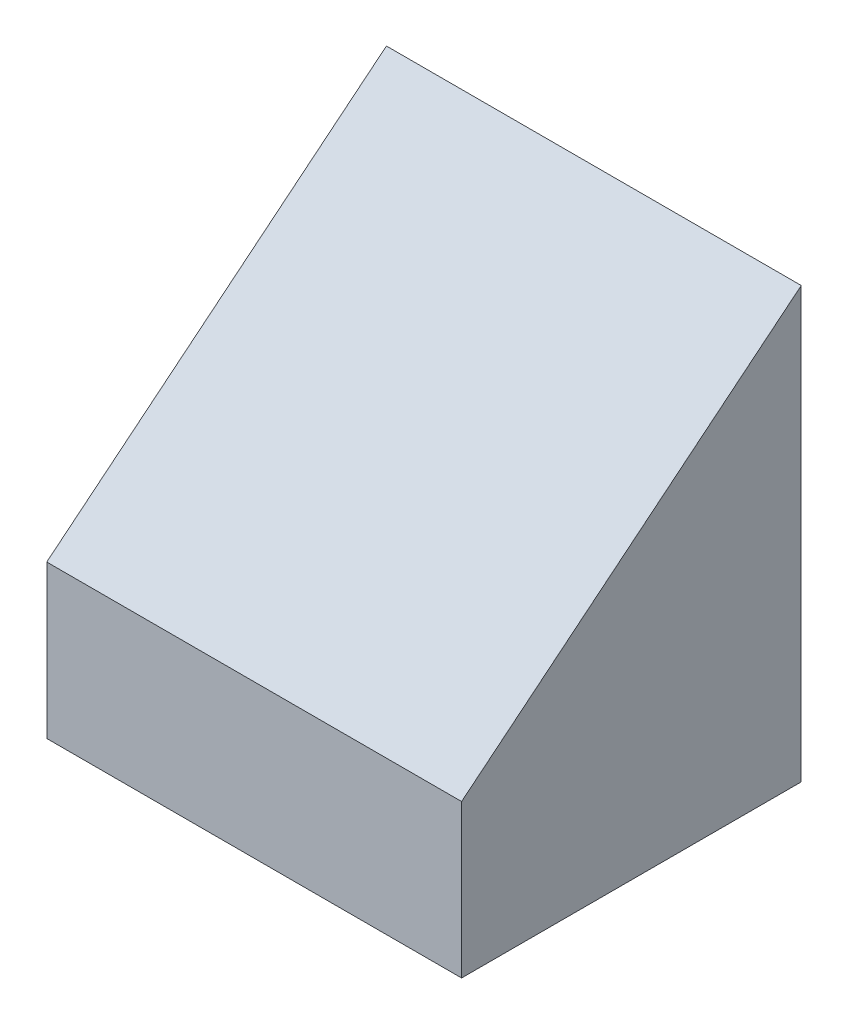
from build123d import *

# Parameters (mm, degrees)
EXTRUDE1_DEPTH = 92.964


with BuildPart() as part:
    # Sketch1 → Extrude1 (new, symmetric)
    with BuildSketch(Plane(origin=(0, 0, 0), x_dir=(0, 0, -1), z_dir=(1, 0, 0))):
        Polygon((0, 0), (152.23637397, 0), (152.23637397, 192.677637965), (0, 68.5013106), align=None)
    extrude(amount=EXTRUDE1_DEPTH, both=True)


solid = part.part
